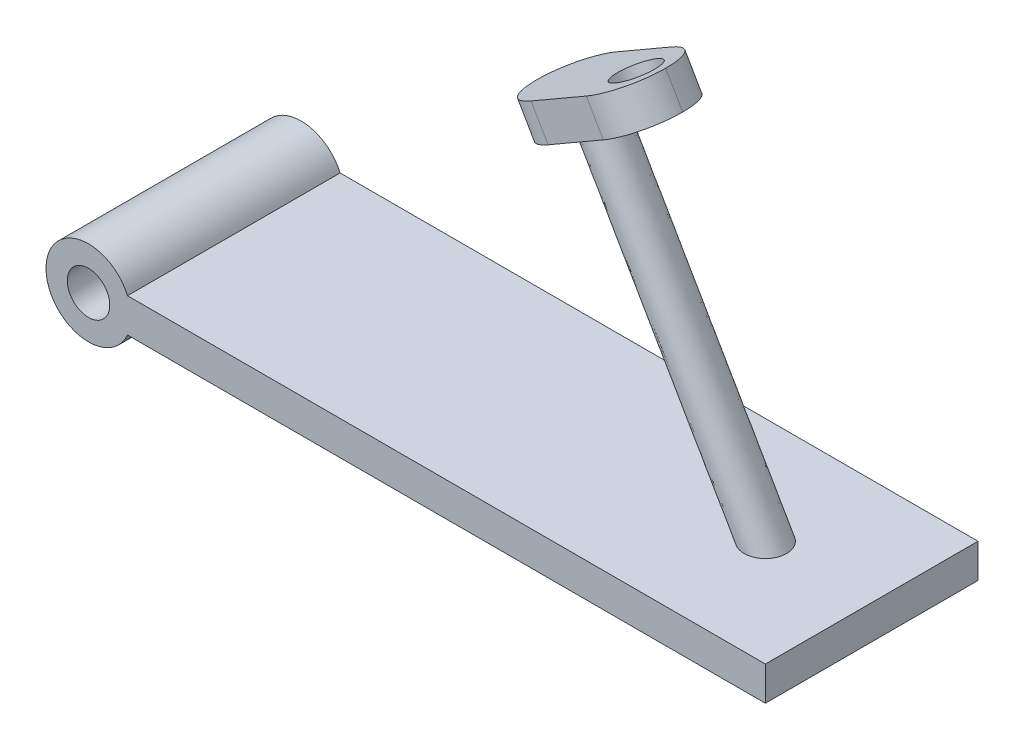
ISO-10303-21;
HEADER;
FILE_DESCRIPTION(('STEP AP214'),'2;1');
FILE_NAME('part.step','',(''),(''),'','','');
FILE_SCHEMA(('AUTOMOTIVE_DESIGN { 1 0 10303 214 1 1 1 1 }'));
ENDSEC;
DATA;
#1=APPLICATION_CONTEXT('core data for automotive mechanical design processes');
#2=APPLICATION_PROTOCOL_DEFINITION('international standard','automotive_design',2000,#1);
#3=PRODUCT_CONTEXT('',#1,'mechanical');
#4=PRODUCT('Part','Part','',(#3));
#5=PRODUCT_RELATED_PRODUCT_CATEGORY('part','',(#4));
#6=PRODUCT_DEFINITION_FORMATION('','',#4);
#7=PRODUCT_DEFINITION_CONTEXT('part definition',#1,'design');
#8=PRODUCT_DEFINITION('design','',#6,#7);
#9=PRODUCT_DEFINITION_SHAPE('','',#8);
#10=(LENGTH_UNIT() NAMED_UNIT(*) SI_UNIT(.MILLI.,.METRE.));
#11=(NAMED_UNIT(*) PLANE_ANGLE_UNIT() SI_UNIT($,.RADIAN.));
#12=(NAMED_UNIT(*) SI_UNIT($,.STERADIAN.) SOLID_ANGLE_UNIT());
#13=UNCERTAINTY_MEASURE_WITH_UNIT(LENGTH_MEASURE(1.E-05),#10,'distance_accuracy_value','');
#14=(GEOMETRIC_REPRESENTATION_CONTEXT(3) GLOBAL_UNCERTAINTY_ASSIGNED_CONTEXT((#13)) GLOBAL_UNIT_ASSIGNED_CONTEXT((#10,
#11,#12)) REPRESENTATION_CONTEXT('',''));
#15=CARTESIAN_POINT('',(0.,0.,0.));
#16=DIRECTION('',(0.,0.,1.));
#17=DIRECTION('',(1.,0.,0.));
#18=AXIS2_PLACEMENT_3D('',#15,#16,#17);
#19=CARTESIAN_POINT('',(64.1651513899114,73.2820323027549,0.));
#20=DIRECTION('',(0.,1.,0.));
#21=DIRECTION('',(0.,0.,0.999999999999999));
#22=AXIS2_PLACEMENT_3D('',#19,#20,#21);
#23=CIRCLE('',#22,5.);
#24=DIRECTION('',(0.500000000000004,-0.866025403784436,0.));
#25=VECTOR('',#24,1.);
#26=SURFACE_OF_LINEAR_EXTRUSION('',#23,#25);
#27=CARTESIAN_POINT('',(104.165151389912,3.99999999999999,0.));
#28=DIRECTION('',(0.,1.,0.));
#29=DIRECTION('',(0.,0.,0.999999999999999));
#30=AXIS2_PLACEMENT_3D('',#27,#28,#29);
#31=CIRCLE('',#30,5.);
#32=CARTESIAN_POINT('',(104.165151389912,3.99999999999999,5.));
#33=VERTEX_POINT('',#32);
#34=EDGE_CURVE('E165',#33,#33,#31,.T.);
#35=ORIENTED_EDGE('',*,*,#34,.T.);
#36=EDGE_LOOP('',(#35));
#37=FACE_BOUND('',#36,.T.);
#38=CARTESIAN_POINT('',(65.6651513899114,70.6839560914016,5.));
#39=CARTESIAN_POINT('',(65.7592594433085,70.7382894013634,5.00000064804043));
#40=CARTESIAN_POINT('',(65.8533609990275,70.7926189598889,4.99527194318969));
#41=CARTESIAN_POINT('',(66.0408883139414,70.9008879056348,4.97641814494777));
#42=CARTESIAN_POINT('',(66.1343138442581,70.9548271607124,4.96229000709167));
#43=CARTESIAN_POINT('',(66.3198834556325,71.0619658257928,4.92479347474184));
#44=CARTESIAN_POINT('',(66.4120257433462,71.115164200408,4.90141327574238));
#45=CARTESIAN_POINT('',(66.5942904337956,71.2203947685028,4.84569835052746));
#46=CARTESIAN_POINT('',(66.6844120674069,71.2724265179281,4.81336027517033));
#47=CARTESIAN_POINT('',(66.8617146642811,71.3747922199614,4.7402428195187));
#48=CARTESIAN_POINT('',(66.9489042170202,71.4251311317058,4.69949115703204));
#49=CARTESIAN_POINT('',(67.1201596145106,71.5240054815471,4.60992466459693));
#50=CARTESIAN_POINT('',(67.2042240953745,71.5725401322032,4.56110636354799));
#51=CARTESIAN_POINT('',(67.3686108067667,71.6674488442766,4.45601172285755));
#52=CARTESIAN_POINT('',(67.4489384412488,71.7138260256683,4.39974663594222));
#53=CARTESIAN_POINT('',(67.6056073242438,71.8042788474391,4.28024457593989));
#54=CARTESIAN_POINT('',(67.6819481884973,71.848354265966,4.21700693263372));
#55=CARTESIAN_POINT('',(67.8340036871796,71.936143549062,4.08082261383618));
#56=CARTESIAN_POINT('',(67.9094995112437,71.9797310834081,4.00754997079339));
#57=CARTESIAN_POINT('',(68.0554218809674,72.0639794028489,3.85463070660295));
#58=CARTESIAN_POINT('',(68.1258494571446,72.1046407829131,3.77498538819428));
#59=CARTESIAN_POINT('',(68.3304618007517,72.2227737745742,3.52587966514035));
#60=CARTESIAN_POINT('',(68.4566143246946,72.2956079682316,3.34748160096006));
#61=CARTESIAN_POINT('',(68.686214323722,72.428167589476,2.97208844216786));
#62=CARTESIAN_POINT('',(68.7896416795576,72.4878814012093,2.77507708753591));
#63=CARTESIAN_POINT('',(68.9357506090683,72.5722374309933,2.45017365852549));
#64=CARTESIAN_POINT('',(68.9860330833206,72.6012680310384,2.32674579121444));
#65=CARTESIAN_POINT('',(69.0782729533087,72.654522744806,2.0759200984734));
#66=CARTESIAN_POINT('',(69.1202374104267,72.6787509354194,1.94852574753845));
#67=CARTESIAN_POINT('',(69.1958453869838,72.7224032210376,1.69049183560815));
#68=CARTESIAN_POINT('',(69.2294889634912,72.7418273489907,1.55985229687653));
#69=CARTESIAN_POINT('',(69.2884436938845,72.7758648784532,1.29608942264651));
#70=CARTESIAN_POINT('',(69.3137530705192,72.7904772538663,1.16296556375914));
#71=CARTESIAN_POINT('',(69.3771315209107,72.8270688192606,0.761067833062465));
#72=CARTESIAN_POINT('',(69.4027206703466,72.8418427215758,0.489527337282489));
#73=CARTESIAN_POINT('',(69.4204941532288,72.8521042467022,-0.0548747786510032));
#74=CARTESIAN_POINT('',(69.4126799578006,72.8475927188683,-0.327736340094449));
#75=CARTESIAN_POINT('',(69.3636768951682,72.8193007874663,-0.869503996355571));
#76=CARTESIAN_POINT('',(69.3224860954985,72.7955192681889,-1.13840986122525));
#77=CARTESIAN_POINT('',(69.2067231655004,72.7286835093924,-1.66658424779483));
#78=CARTESIAN_POINT('',(69.132145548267,72.6856261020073,-1.92585117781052));
#79=CARTESIAN_POINT('',(68.949810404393,72.5803548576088,-2.42849366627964));
#80=CARTESIAN_POINT('',(68.8420435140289,72.5181356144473,-2.67186471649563));
#81=CARTESIAN_POINT('',(68.5946970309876,72.3753300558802,-3.13409717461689));
#82=CARTESIAN_POINT('',(68.4553408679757,72.2948727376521,-3.35311534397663));
#83=CARTESIAN_POINT('',(68.2291261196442,72.1642675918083,-3.65118074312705));
#84=CARTESIAN_POINT('',(68.1540721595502,72.1209351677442,-3.7424204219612));
#85=CARTESIAN_POINT('',(67.9976861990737,72.0306456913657,-3.91741028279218));
#86=CARTESIAN_POINT('',(67.9163566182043,71.9836900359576,-4.00116332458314));
#87=CARTESIAN_POINT('',(67.7532451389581,71.8895175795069,-4.15514613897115));
#88=CARTESIAN_POINT('',(67.6718342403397,71.8425149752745,-4.22590058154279));
#89=CARTESIAN_POINT('',(67.5041135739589,71.7456814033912,-4.35946311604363));
#90=CARTESIAN_POINT('',(67.41779842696,71.6958473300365,-4.42226222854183));
#91=CARTESIAN_POINT('',(67.2444133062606,71.5957433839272,-4.5367455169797));
#92=CARTESIAN_POINT('',(67.1575152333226,71.5455727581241,-4.58877664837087));
#93=CARTESIAN_POINT('',(66.9802321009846,71.4432182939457,-4.684195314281));
#94=CARTESIAN_POINT('',(66.8898473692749,71.3910346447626,-4.72758365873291));
#95=CARTESIAN_POINT('',(66.7062064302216,71.285009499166,-4.80517831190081));
#96=CARTESIAN_POINT('',(66.6129514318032,71.2311687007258,-4.83938842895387));
#97=CARTESIAN_POINT('',(66.4242382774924,71.1222151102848,-4.89819393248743));
#98=CARTESIAN_POINT('',(66.3287812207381,71.0671029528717,-4.92279401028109));
#99=CARTESIAN_POINT('',(66.1395467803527,70.9578483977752,-4.96141643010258));
#100=CARTESIAN_POINT('',(66.0458190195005,70.9037346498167,-4.97576316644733));
#101=CARTESIAN_POINT('',(65.8576565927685,70.7950990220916,-4.99499166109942));
#102=CARTESIAN_POINT('',(65.7632220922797,70.7405772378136,-4.99987556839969));
#103=CARTESIAN_POINT('',(65.5772542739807,70.6332086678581,-5.00011597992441));
#104=CARTESIAN_POINT('',(65.485721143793,70.5803619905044,-4.99576116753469));
#105=CARTESIAN_POINT('',(65.3032685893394,70.4750229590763,-4.9781586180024));
#106=CARTESIAN_POINT('',(65.2123493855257,70.4225307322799,-4.96490784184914));
#107=CARTESIAN_POINT('',(65.0316627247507,70.3182112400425,-4.92964487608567));
#108=CARTESIAN_POINT('',(64.9418970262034,70.2663849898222,-4.90762064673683));
#109=CARTESIAN_POINT('',(64.764237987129,70.1638134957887,-4.8550819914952));
#110=CARTESIAN_POINT('',(64.676345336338,70.1130686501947,-4.8245644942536));
#111=CARTESIAN_POINT('',(64.4151082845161,69.962243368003,-4.72026700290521));
#112=CARTESIAN_POINT('',(64.2453946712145,69.8642591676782,-4.63397834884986));
#113=CARTESIAN_POINT('',(63.9200008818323,69.6763929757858,-4.43203752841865));
#114=CARTESIAN_POINT('',(63.7643051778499,69.5865020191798,-4.31641840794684));
#115=CARTESIAN_POINT('',(63.5385113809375,69.4561399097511,-4.12012620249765));
#116=CARTESIAN_POINT('',(63.4624440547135,69.4122224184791,-4.04840875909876));
#117=CARTESIAN_POINT('',(63.3152674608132,69.3272499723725,-3.89851660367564));
#118=CARTESIAN_POINT('',(63.2441573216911,69.2861945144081,-3.82034303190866));
#119=CARTESIAN_POINT('',(63.0373641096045,69.1668023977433,-3.57556857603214));
#120=CARTESIAN_POINT('',(62.9095935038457,69.093034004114,-3.39992177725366));
#121=CARTESIAN_POINT('',(62.6764822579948,68.9584471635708,-3.02971184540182));
#122=CARTESIAN_POINT('',(62.5711614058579,68.8976401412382,-2.83513224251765));
#123=CARTESIAN_POINT('',(62.4219517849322,68.8114939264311,-2.5140567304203));
#124=CARTESIAN_POINT('',(62.3705215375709,68.7818006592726,-2.39213866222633));
#125=CARTESIAN_POINT('',(62.2758817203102,68.7271603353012,-2.14423035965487));
#126=CARTESIAN_POINT('',(62.2326651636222,68.7022092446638,-2.01824369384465));
#127=CARTESIAN_POINT('',(62.1544520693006,68.6570528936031,-1.7629200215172));
#128=CARTESIAN_POINT('',(62.1194554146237,68.6368475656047,-1.63358306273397));
#129=CARTESIAN_POINT('',(62.0576956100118,68.6011905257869,-1.37231335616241));
#130=CARTESIAN_POINT('',(62.0309342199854,68.5857398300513,-1.24038005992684));
#131=CARTESIAN_POINT('',(61.9630551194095,68.5465498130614,-0.841878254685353));
#132=CARTESIAN_POINT('',(61.9342699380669,68.5299306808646,-0.572368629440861));
#133=CARTESIAN_POINT('',(61.9097194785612,68.5157564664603,-0.0314889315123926));
#134=CARTESIAN_POINT('',(61.9139524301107,68.5182003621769,0.23988104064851));
#135=CARTESIAN_POINT('',(61.9554045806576,68.5421327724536,0.779302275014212));
#136=CARTESIAN_POINT('',(61.9926252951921,68.5636221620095,1.04735338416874));
#137=CARTESIAN_POINT('',(62.1000656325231,68.6256528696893,1.57459658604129));
#138=CARTESIAN_POINT('',(62.1702901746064,68.6661970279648,1.83378735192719));
#139=CARTESIAN_POINT('',(62.3435685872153,68.7662393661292,2.33724310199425));
#140=CARTESIAN_POINT('',(62.4466310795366,68.8257425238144,2.58150414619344));
#141=CARTESIAN_POINT('',(62.6852049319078,68.9634832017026,3.04841744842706));
#142=CARTESIAN_POINT('',(62.8207289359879,69.0417280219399,3.27106123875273));
#143=CARTESIAN_POINT('',(63.04217490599,69.1695799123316,3.57593094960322));
#144=CARTESIAN_POINT('',(63.11619911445,69.2123178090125,3.66991749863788));
#145=CARTESIAN_POINT('',(63.2707280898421,69.3015351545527,3.85048886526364));
#146=CARTESIAN_POINT('',(63.3512304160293,69.3480131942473,3.93707644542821));
#147=CARTESIAN_POINT('',(63.5128494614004,69.4413239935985,4.09650855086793));
#148=CARTESIAN_POINT('',(63.5935746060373,69.487930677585,4.16988301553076));
#149=CARTESIAN_POINT('',(63.7601105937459,69.5840802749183,4.30874503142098));
#150=CARTESIAN_POINT('',(63.8459268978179,69.6336263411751,4.37422387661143));
#151=CARTESIAN_POINT('',(64.0183875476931,69.7331965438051,4.49389052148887));
#152=CARTESIAN_POINT('',(64.1048447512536,69.7831126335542,4.54843774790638));
#153=CARTESIAN_POINT('',(64.2814305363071,69.8850644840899,4.64892439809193));
#154=CARTESIAN_POINT('',(64.3715587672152,69.9371000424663,4.69486464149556));
#155=CARTESIAN_POINT('',(64.5548950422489,70.0429492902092,4.77757586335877));
#156=CARTESIAN_POINT('',(64.6481022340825,70.0967624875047,4.81434935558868));
#157=CARTESIAN_POINT('',(64.8369208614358,70.2057769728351,4.87825427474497));
#158=CARTESIAN_POINT('',(64.9325312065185,70.2609776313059,4.90538999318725));
#159=CARTESIAN_POINT('',(65.1336765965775,70.3771089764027,4.9515540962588));
#160=CARTESIAN_POINT('',(65.2393649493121,70.4381281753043,4.96969829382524));
#161=CARTESIAN_POINT('',(65.4517555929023,70.5607519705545,4.99391961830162));
#162=CARTESIAN_POINT('',(65.5584576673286,70.6223564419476,4.99999926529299));
#163=CARTESIAN_POINT('',(65.6651513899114,70.6839560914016,5.));
#164=B_SPLINE_CURVE_WITH_KNOTS('',3,(#38,#39,#40,#41,#42,#43,#44,#45,#46,#47,#48,#49,#50,#51,
#52,#53,#54,#55,#56,#57,#58,#59,#60,#61,#62,#63,#64,#65,#66,#67,#68,#69,#70,#71,#72,#73,#74,#75,
#76,#77,#78,#79,#80,#81,#82,#83,#84,#85,#86,#87,#88,#89,#90,#91,#92,#93,#94,#95,#96,#97,#98,#99,
#100,#101,#102,#103,#104,#105,#106,#107,#108,#109,#110,#111,#112,#113,#114,#115,#116,#117,#118,
#119,#120,#121,#122,#123,#124,#125,#126,#127,#128,#129,#130,#131,#132,#133,#134,#135,#136,#137,
#138,#139,#140,#141,#142,#143,#144,#145,#146,#147,#148,#149,#150,#151,#152,#153,#154,#155,#156,
#157,#158,#159,#160,#161,#162,#163),.UNSPECIFIED.,.T.,.F.,(4,2,2,2,2,2,2,2,2,2,2,2,2,2,2,2,2,2,
2,2,2,2,2,2,2,2,2,2,2,2,2,2,2,2,2,2,2,2,2,2,2,2,2,2,2,2,2,2,2,2,2,2,2,2,2,2,2,2,2,2,2,2,4),(0.,
0.325884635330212,0.651874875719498,0.978282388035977,1.30481210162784,1.63028278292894,
1.9558938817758,2.28101845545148,2.60617430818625,2.94745545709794,3.28866701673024,
3.9770230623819,4.66598609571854,5.07483576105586,5.48333684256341,5.89183512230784,
6.30042045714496,7.11683738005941,7.93321834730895,8.74964658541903,9.56620904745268,
10.3830020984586,11.1941889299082,11.5713604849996,11.9483873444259,12.3009765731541,
12.6539603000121,12.9926594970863,13.3313269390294,13.6698536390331,14.008214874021,
14.3353300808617,14.6623709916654,14.9793435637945,15.2964244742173,15.6139420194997,
15.9315745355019,16.5709711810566,17.2096506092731,17.5495412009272,17.8893718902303,
18.5749576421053,19.2611452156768,19.6676295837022,20.0737666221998,20.4798978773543,
20.8861158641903,21.697798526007,22.5094376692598,23.3211141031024,24.1329115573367,
24.9449223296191,25.7572499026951,26.1380252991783,26.5186578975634,26.8741566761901,
27.230043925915,27.5709403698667,27.911804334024,28.2525747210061,28.5931931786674,
28.962737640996,29.3322049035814),.UNSPECIFIED.);
#165=CARTESIAN_POINT('',(65.6651513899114,70.6839560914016,5.));
#166=VERTEX_POINT('',#165);
#167=EDGE_CURVE('E138',#166,#166,#164,.T.);
#168=ORIENTED_EDGE('',*,*,#167,.F.);
#169=EDGE_LOOP('',(#168));
#170=FACE_BOUND('',#169,.T.);
#171=ADVANCED_FACE('F48',(#37,#170),#26,.F.);
#172=CARTESIAN_POINT('',(0.,4.,25.));
#173=DIRECTION('',(0.,1.,0.));
#174=DIRECTION('',(0.,0.,0.999999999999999));
#175=AXIS2_PLACEMENT_3D('',#172,#173,#174);
#176=PLANE('',#175);
#177=ORIENTED_EDGE('',*,*,#34,.F.);
#178=EDGE_LOOP('',(#177));
#179=FACE_BOUND('',#178,.T.);
#180=DIRECTION('',(1.,0.,0.));
#181=VECTOR('',#180,1.);
#182=CARTESIAN_POINT('',(0.,4.,-25.));
#183=LINE('',#182,#181);
#184=CARTESIAN_POINT('',(-20.8348486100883,4.,-25.));
#185=VERTEX_POINT('',#184);
#186=CARTESIAN_POINT('',(129.165151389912,4.,-25.));
#187=VERTEX_POINT('',#186);
#188=EDGE_CURVE('E134',#185,#187,#183,.T.);
#189=ORIENTED_EDGE('',*,*,#188,.F.);
#190=DIRECTION('',(0.,0.,-0.999999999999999));
#191=VECTOR('',#190,1.);
#192=CARTESIAN_POINT('',(-20.8348486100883,4.,25.));
#193=LINE('',#192,#191);
#194=CARTESIAN_POINT('',(-20.8348486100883,4.,25.));
#195=VERTEX_POINT('',#194);
#196=EDGE_CURVE('E127',#195,#185,#193,.T.);
#197=ORIENTED_EDGE('',*,*,#196,.F.);
#198=DIRECTION('',(1.,0.,0.));
#199=VECTOR('',#198,1.);
#200=CARTESIAN_POINT('',(0.,4.,25.));
#201=LINE('',#200,#199);
#202=CARTESIAN_POINT('',(129.165151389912,4.,25.));
#203=VERTEX_POINT('',#202);
#204=EDGE_CURVE('E131',#195,#203,#201,.T.);
#205=ORIENTED_EDGE('',*,*,#204,.T.);
#206=DIRECTION('',(0.,0.,-0.999999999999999));
#207=VECTOR('',#206,1.);
#208=CARTESIAN_POINT('',(129.165151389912,4.,25.));
#209=LINE('',#208,#207);
#210=EDGE_CURVE('E161',#203,#187,#209,.T.);
#211=ORIENTED_EDGE('',*,*,#210,.T.);
#212=EDGE_LOOP('',(#189,#197,#205,#211));
#213=FACE_BOUND('',#212,.T.);
#214=ADVANCED_FACE('F129',(#179,#213),#176,.T.);
#215=CARTESIAN_POINT('',(-30.,0.,25.));
#216=DIRECTION('',(0.,0.,-0.999999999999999));
#217=DIRECTION('',(-1.,0.,0.));
#218=AXIS2_PLACEMENT_3D('',#215,#216,#217);
#219=CYLINDRICAL_SURFACE('',#218,10.);
#220=CARTESIAN_POINT('',(-30.,0.,-25.));
#221=DIRECTION('',(0.,0.,0.999999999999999));
#222=DIRECTION('',(1.,0.,0.));
#223=AXIS2_PLACEMENT_3D('',#220,#221,#222);
#224=CIRCLE('',#223,10.);
#225=CARTESIAN_POINT('',(-20.8348486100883,-4.,-25.));
#226=VERTEX_POINT('',#225);
#227=EDGE_CURVE('E167',#185,#226,#224,.T.);
#228=ORIENTED_EDGE('',*,*,#227,.T.);
#229=DIRECTION('',(0.,0.,-0.999999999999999));
#230=VECTOR('',#229,1.);
#231=CARTESIAN_POINT('',(-20.8348486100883,-4.,25.));
#232=LINE('',#231,#230);
#233=CARTESIAN_POINT('',(-20.8348486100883,-4.,25.));
#234=VERTEX_POINT('',#233);
#235=EDGE_CURVE('E139',#234,#226,#232,.T.);
#236=ORIENTED_EDGE('',*,*,#235,.F.);
#237=CARTESIAN_POINT('',(-30.,0.,25.));
#238=DIRECTION('',(0.,0.,0.999999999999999));
#239=DIRECTION('',(1.,0.,0.));
#240=AXIS2_PLACEMENT_3D('',#237,#238,#239);
#241=CIRCLE('',#240,10.);
#242=EDGE_CURVE('E143',#195,#234,#241,.T.);
#243=ORIENTED_EDGE('',*,*,#242,.F.);
#244=ORIENTED_EDGE('',*,*,#196,.T.);
#245=EDGE_LOOP('',(#228,#236,#243,#244));
#246=FACE_BOUND('',#245,.T.);
#247=ADVANCED_FACE('F144',(#246),#219,.T.);
#248=CARTESIAN_POINT('',(0.,-4.,25.));
#249=DIRECTION('',(0.,1.,0.));
#250=DIRECTION('',(-1.,0.,0.));
#251=AXIS2_PLACEMENT_3D('',#248,#249,#250);
#252=PLANE('',#251);
#253=DIRECTION('',(1.,0.,0.));
#254=VECTOR('',#253,1.);
#255=CARTESIAN_POINT('',(0.,-4.,-25.));
#256=LINE('',#255,#254);
#257=CARTESIAN_POINT('',(129.165151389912,-3.99999999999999,-25.));
#258=VERTEX_POINT('',#257);
#259=EDGE_CURVE('E169',#226,#258,#256,.T.);
#260=ORIENTED_EDGE('',*,*,#259,.T.);
#261=DIRECTION('',(0.,0.,-0.999999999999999));
#262=VECTOR('',#261,1.);
#263=CARTESIAN_POINT('',(129.165151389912,-3.99999999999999,25.));
#264=LINE('',#263,#262);
#265=CARTESIAN_POINT('',(129.165151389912,-3.99999999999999,25.));
#266=VERTEX_POINT('',#265);
#267=EDGE_CURVE('E175',#266,#258,#264,.T.);
#268=ORIENTED_EDGE('',*,*,#267,.F.);
#269=DIRECTION('',(1.,0.,0.));
#270=VECTOR('',#269,1.);
#271=CARTESIAN_POINT('',(0.,-4.,25.));
#272=LINE('',#271,#270);
#273=EDGE_CURVE('E147',#234,#266,#272,.T.);
#274=ORIENTED_EDGE('',*,*,#273,.F.);
#275=ORIENTED_EDGE('',*,*,#235,.T.);
#276=EDGE_LOOP('',(#260,#268,#274,#275));
#277=FACE_BOUND('',#276,.T.);
#278=ADVANCED_FACE('F353',(#277),#252,.F.);
#279=CARTESIAN_POINT('',(-30.,0.,25.));
#280=DIRECTION('',(0.,0.,-0.999999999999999));
#281=DIRECTION('',(-1.,0.,0.));
#282=AXIS2_PLACEMENT_3D('',#279,#280,#281);
#283=CYLINDRICAL_SURFACE('',#282,5.);
#284=CARTESIAN_POINT('',(-30.,0.,25.));
#285=DIRECTION('',(0.,0.,0.999999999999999));
#286=DIRECTION('',(1.,0.,0.));
#287=AXIS2_PLACEMENT_3D('',#284,#285,#286);
#288=CIRCLE('',#287,5.);
#289=CARTESIAN_POINT('',(-35.,0.,25.));
#290=VERTEX_POINT('',#289);
#291=EDGE_CURVE('E152',#290,#290,#288,.T.);
#292=CARTESIAN_POINT('',(-30.,0.,-25.));
#293=DIRECTION('',(0.,0.,0.999999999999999));
#294=DIRECTION('',(1.,0.,0.));
#295=AXIS2_PLACEMENT_3D('',#292,#293,#294);
#296=CIRCLE('',#295,5.);
#297=CARTESIAN_POINT('',(-35.,0.,-25.));
#298=VERTEX_POINT('',#297);
#299=EDGE_CURVE('E162',#298,#298,#296,.T.);
#300=CARTESIAN_POINT('',(-35.,0.,25.));
#301=CARTESIAN_POINT('',(-35.,0.,24.4791666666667));
#302=CARTESIAN_POINT('',(-35.,0.,23.9583333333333));
#303=CARTESIAN_POINT('',(-35.,0.,22.9166666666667));
#304=CARTESIAN_POINT('',(-35.,0.,22.3958333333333));
#305=CARTESIAN_POINT('',(-35.,0.,21.3541666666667));
#306=CARTESIAN_POINT('',(-35.,0.,20.8333333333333));
#307=CARTESIAN_POINT('',(-35.,0.,19.7916666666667));
#308=CARTESIAN_POINT('',(-35.,0.,19.2708333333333));
#309=CARTESIAN_POINT('',(-35.,0.,18.2291666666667));
#310=CARTESIAN_POINT('',(-35.,0.,17.7083333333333));
#311=CARTESIAN_POINT('',(-35.,0.,16.6666666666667));
#312=CARTESIAN_POINT('',(-35.,0.,16.1458333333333));
#313=CARTESIAN_POINT('',(-35.,0.,15.1041666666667));
#314=CARTESIAN_POINT('',(-35.,0.,14.5833333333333));
#315=CARTESIAN_POINT('',(-35.,0.,13.5416666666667));
#316=CARTESIAN_POINT('',(-35.,0.,13.0208333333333));
#317=CARTESIAN_POINT('',(-35.,0.,11.9791666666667));
#318=CARTESIAN_POINT('',(-35.,0.,11.4583333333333));
#319=CARTESIAN_POINT('',(-35.,0.,10.4166666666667));
#320=CARTESIAN_POINT('',(-35.,0.,9.89583333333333));
#321=CARTESIAN_POINT('',(-35.,0.,8.85416666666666));
#322=CARTESIAN_POINT('',(-35.,0.,8.33333333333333));
#323=CARTESIAN_POINT('',(-35.,0.,7.29166666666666));
#324=CARTESIAN_POINT('',(-35.,0.,6.77083333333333));
#325=CARTESIAN_POINT('',(-35.,0.,5.72916666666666));
#326=CARTESIAN_POINT('',(-35.,0.,5.20833333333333));
#327=CARTESIAN_POINT('',(-35.,0.,4.16666666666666));
#328=CARTESIAN_POINT('',(-35.,0.,3.64583333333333));
#329=CARTESIAN_POINT('',(-35.,0.,2.60416666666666));
#330=CARTESIAN_POINT('',(-35.,0.,2.08333333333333));
#331=CARTESIAN_POINT('',(-35.,0.,1.04166666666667));
#332=CARTESIAN_POINT('',(-35.,0.,0.520833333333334));
#333=CARTESIAN_POINT('',(-35.,0.,-0.520833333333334));
#334=CARTESIAN_POINT('',(-35.,0.,-1.04166666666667));
#335=CARTESIAN_POINT('',(-35.,0.,-2.08333333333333));
#336=CARTESIAN_POINT('',(-35.,0.,-2.60416666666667));
#337=CARTESIAN_POINT('',(-35.,0.,-3.64583333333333));
#338=CARTESIAN_POINT('',(-35.,0.,-4.16666666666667));
#339=CARTESIAN_POINT('',(-35.,0.,-5.20833333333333));
#340=CARTESIAN_POINT('',(-35.,0.,-5.72916666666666));
#341=CARTESIAN_POINT('',(-35.,0.,-6.77083333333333));
#342=CARTESIAN_POINT('',(-35.,0.,-7.29166666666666));
#343=CARTESIAN_POINT('',(-35.,0.,-8.33333333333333));
#344=CARTESIAN_POINT('',(-35.,0.,-8.85416666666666));
#345=CARTESIAN_POINT('',(-35.,0.,-9.89583333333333));
#346=CARTESIAN_POINT('',(-35.,0.,-10.4166666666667));
#347=CARTESIAN_POINT('',(-35.,0.,-11.4583333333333));
#348=CARTESIAN_POINT('',(-35.,0.,-11.9791666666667));
#349=CARTESIAN_POINT('',(-35.,0.,-13.0208333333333));
#350=CARTESIAN_POINT('',(-35.,0.,-13.5416666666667));
#351=CARTESIAN_POINT('',(-35.,0.,-14.5833333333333));
#352=CARTESIAN_POINT('',(-35.,0.,-15.1041666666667));
#353=CARTESIAN_POINT('',(-35.,0.,-16.1458333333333));
#354=CARTESIAN_POINT('',(-35.,0.,-16.6666666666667));
#355=CARTESIAN_POINT('',(-35.,0.,-17.7083333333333));
#356=CARTESIAN_POINT('',(-35.,0.,-18.2291666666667));
#357=CARTESIAN_POINT('',(-35.,0.,-19.2708333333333));
#358=CARTESIAN_POINT('',(-35.,0.,-19.7916666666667));
#359=CARTESIAN_POINT('',(-35.,0.,-20.8333333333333));
#360=CARTESIAN_POINT('',(-35.,0.,-21.3541666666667));
#361=CARTESIAN_POINT('',(-35.,0.,-22.3958333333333));
#362=CARTESIAN_POINT('',(-35.,0.,-22.9166666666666));
#363=CARTESIAN_POINT('',(-35.,0.,-23.9583333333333));
#364=CARTESIAN_POINT('',(-35.,0.,-24.4791666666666));
#365=CARTESIAN_POINT('',(-35.,0.,-25.));
#366=B_SPLINE_CURVE_WITH_KNOTS('',3,(#300,#301,#302,#303,#304,#305,#306,#307,#308,#309,#310,
#311,#312,#313,#314,#315,#316,#317,#318,#319,#320,#321,#322,#323,#324,#325,#326,#327,#328,#329,
#330,#331,#332,#333,#334,#335,#336,#337,#338,#339,#340,#341,#342,#343,#344,#345,#346,#347,#348,
#349,#350,#351,#352,#353,#354,#355,#356,#357,#358,#359,#360,#361,#362,#363,#364,#365),
.UNSPECIFIED.,.F.,.F.,(4,2,2,2,2,2,2,2,2,2,2,2,2,2,2,2,2,2,2,2,2,2,2,2,2,2,2,2,2,2,2,2,4),(0.,
1.5625,3.125,4.68749999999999,6.25,7.81249999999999,9.37499999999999,10.9375,12.5,14.0625,
15.625,17.1875,18.75,20.3125,21.875,23.4375,25.,26.5625,28.125,29.6875,31.25,32.8125,34.375,
35.9375,37.5,39.0625,40.625,42.1875,43.75,45.3125,46.875,48.4375,50.),.UNSPECIFIED.);
#367=EDGE_CURVE('BSEAM288',#290,#298,#366,.T.);
#368=ORIENTED_EDGE('',*,*,#291,.T.);
#369=ORIENTED_EDGE('',*,*,#299,.F.);
#370=ORIENTED_EDGE('',*,*,#367,.T.);
#371=ORIENTED_EDGE('',*,*,#367,.F.);
#372=EDGE_LOOP('',(#368,#370,#369,#371));
#373=FACE_BOUND('',#372,.T.);
#374=ADVANCED_FACE('F288',(#373),#283,.F.);
#375=CARTESIAN_POINT('',(129.165151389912,0.,25.));
#376=DIRECTION('',(1.,0.,0.));
#377=DIRECTION('',(0.,0.,-0.999999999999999));
#378=AXIS2_PLACEMENT_3D('',#375,#376,#377);
#379=PLANE('',#378);
#380=DIRECTION('',(0.,-1.,0.));
#381=VECTOR('',#380,1.);
#382=CARTESIAN_POINT('',(129.165151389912,0.,-25.));
#383=LINE('',#382,#381);
#384=EDGE_CURVE('E155',#187,#258,#383,.T.);
#385=ORIENTED_EDGE('',*,*,#384,.F.);
#386=ORIENTED_EDGE('',*,*,#210,.F.);
#387=DIRECTION('',(0.,-1.,0.));
#388=VECTOR('',#387,1.);
#389=CARTESIAN_POINT('',(129.165151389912,0.,25.));
#390=LINE('',#389,#388);
#391=EDGE_CURVE('E151',#203,#266,#390,.T.);
#392=ORIENTED_EDGE('',*,*,#391,.T.);
#393=ORIENTED_EDGE('',*,*,#267,.T.);
#394=EDGE_LOOP('',(#385,#386,#392,#393));
#395=FACE_BOUND('',#394,.T.);
#396=ADVANCED_FACE('F339',(#395),#379,.T.);
#397=CARTESIAN_POINT('',(0.,0.,25.));
#398=DIRECTION('',(0.,0.,0.999999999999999));
#399=DIRECTION('',(1.,0.,0.));
#400=AXIS2_PLACEMENT_3D('',#397,#398,#399);
#401=PLANE('',#400);
#402=ORIENTED_EDGE('',*,*,#291,.F.);
#403=EDGE_LOOP('',(#402));
#404=FACE_BOUND('',#403,.T.);
#405=ORIENTED_EDGE('',*,*,#204,.F.);
#406=ORIENTED_EDGE('',*,*,#242,.T.);
#407=ORIENTED_EDGE('',*,*,#273,.T.);
#408=ORIENTED_EDGE('',*,*,#391,.F.);
#409=EDGE_LOOP('',(#405,#406,#407,#408));
#410=FACE_BOUND('',#409,.T.);
#411=ADVANCED_FACE('F149',(#404,#410),#401,.T.);
#412=CARTESIAN_POINT('',(0.,0.,-25.));
#413=DIRECTION('',(0.,0.,0.999999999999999));
#414=DIRECTION('',(1.,0.,0.));
#415=AXIS2_PLACEMENT_3D('',#412,#413,#414);
#416=PLANE('',#415);
#417=ORIENTED_EDGE('',*,*,#299,.T.);
#418=EDGE_LOOP('',(#417));
#419=FACE_BOUND('',#418,.T.);
#420=ORIENTED_EDGE('',*,*,#188,.T.);
#421=ORIENTED_EDGE('',*,*,#384,.T.);
#422=ORIENTED_EDGE('',*,*,#259,.F.);
#423=ORIENTED_EDGE('',*,*,#227,.F.);
#424=EDGE_LOOP('',(#420,#421,#422,#423));
#425=FACE_BOUND('',#424,.T.);
#426=ADVANCED_FACE('F195',(#419,#425),#416,.F.);
#427=CARTESIAN_POINT('',(65.6651513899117,70.6839560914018,9.99999999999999));
#428=DIRECTION('',(-0.5,0.866025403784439,0.));
#429=DIRECTION('',(-0.866025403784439,-0.5,0.));
#430=AXIS2_PLACEMENT_3D('',#427,#428,#429);
#431=PLANE('',#430);
#432=CARTESIAN_POINT('',(77.7895070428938,77.6839560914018,0.));
#433=DIRECTION('',(-0.5,0.866025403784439,0.));
#434=DIRECTION('',(-0.866025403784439,-0.5,0.));
#435=AXIS2_PLACEMENT_3D('',#432,#433,#434);
#436=CIRCLE('',#435,5.00000000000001);
#437=CARTESIAN_POINT('',(73.4593800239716,75.1839560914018,0.));
#438=VERTEX_POINT('',#437);
#439=EDGE_CURVE('E229',#438,#438,#436,.F.);
#440=ORIENTED_EDGE('',*,*,#439,.F.);
#441=EDGE_LOOP('',(#440));
#442=FACE_BOUND('',#441,.T.);
#443=DIRECTION('',(0.86602540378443,0.500000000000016,0.));
#444=VECTOR('',#443,1.);
#445=CARTESIAN_POINT('',(84.7177102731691,81.6839560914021,9.99999999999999));
#446=LINE('',#445,#444);
#447=CARTESIAN_POINT('',(63.0670751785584,69.1839560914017,9.99999999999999));
#448=VERTEX_POINT('',#447);
#449=CARTESIAN_POINT('',(76.0574562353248,76.6839560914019,9.99999999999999));
#450=VERTEX_POINT('',#449);
#451=EDGE_CURVE('E221',#448,#450,#446,.T.);
#452=ORIENTED_EDGE('',*,*,#451,.F.);
#453=CARTESIAN_POINT('',(63.0670751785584,69.1839560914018,0.));
#454=DIRECTION('',(-0.5,0.866025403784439,0.));
#455=DIRECTION('',(-0.866025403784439,-0.5,0.));
#456=AXIS2_PLACEMENT_3D('',#453,#454,#455);
#457=CIRCLE('',#456,10.);
#458=CARTESIAN_POINT('',(54.406821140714,64.1839560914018,0.));
#459=VERTEX_POINT('',#458);
#460=EDGE_CURVE('E252',#448,#459,#457,.F.);
#461=ORIENTED_EDGE('',*,*,#460,.T.);
#462=CARTESIAN_POINT('',(63.0670751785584,69.1839560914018,0.));
#463=DIRECTION('',(-0.5,0.866025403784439,0.));
#464=DIRECTION('',(-0.866025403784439,-0.5,0.));
#465=AXIS2_PLACEMENT_3D('',#462,#463,#464);
#466=CIRCLE('',#465,10.);
#467=CARTESIAN_POINT('',(63.0670751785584,69.1839560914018,-9.99999999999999));
#468=VERTEX_POINT('',#467);
#469=EDGE_CURVE('E254',#459,#468,#466,.F.);
#470=ORIENTED_EDGE('',*,*,#469,.T.);
#471=DIRECTION('',(0.866025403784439,0.5,0.));
#472=VECTOR('',#471,1.);
#473=CARTESIAN_POINT('',(65.6651513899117,70.6839560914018,-9.99999999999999));
#474=LINE('',#473,#472);
#475=CARTESIAN_POINT('',(76.0574562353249,76.6839560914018,-9.99999999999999));
#476=VERTEX_POINT('',#475);
#477=EDGE_CURVE('E225',#468,#476,#474,.T.);
#478=ORIENTED_EDGE('',*,*,#477,.T.);
#479=CARTESIAN_POINT('',(76.0574562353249,76.6839560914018,0.));
#480=DIRECTION('',(-0.5,0.866025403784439,0.));
#481=DIRECTION('',(-0.866025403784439,-0.5,0.));
#482=AXIS2_PLACEMENT_3D('',#479,#480,#481);
#483=CIRCLE('',#482,10.);
#484=CARTESIAN_POINT('',(84.7177102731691,81.6839560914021,0.));
#485=VERTEX_POINT('',#484);
#486=EDGE_CURVE('E256',#476,#485,#483,.F.);
#487=ORIENTED_EDGE('',*,*,#486,.T.);
#488=CARTESIAN_POINT('',(76.0574562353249,76.6839560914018,0.));
#489=DIRECTION('',(-0.5,0.866025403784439,0.));
#490=DIRECTION('',(-0.866025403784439,-0.5,0.));
#491=AXIS2_PLACEMENT_3D('',#488,#489,#490);
#492=CIRCLE('',#491,10.);
#493=EDGE_CURVE('E258',#485,#450,#492,.F.);
#494=ORIENTED_EDGE('',*,*,#493,.T.);
#495=EDGE_LOOP('',(#452,#461,#470,#478,#487,#494));
#496=FACE_BOUND('',#495,.T.);
#497=ORIENTED_EDGE('',*,*,#167,.T.);
#498=EDGE_LOOP('',(#497));
#499=FACE_BOUND('',#498,.T.);
#500=ADVANCED_FACE('F190',(#442,#496,#499),#431,.F.);
#501=CARTESIAN_POINT('',(50.4068211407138,71.1121593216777,9.99999999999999));
#502=DIRECTION('',(0.5,-0.866025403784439,0.));
#503=DIRECTION('',(0.866025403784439,0.5,0.));
#504=AXIS2_PLACEMENT_3D('',#501,#502,#503);
#505=PLANE('',#504);
#506=CARTESIAN_POINT('',(73.7895070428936,84.6121593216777,0.));
#507=DIRECTION('',(-0.5,0.866025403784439,0.));
#508=DIRECTION('',(-0.866025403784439,-0.5,0.));
#509=AXIS2_PLACEMENT_3D('',#506,#507,#508);
#510=CIRCLE('',#509,5.00000000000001);
#511=CARTESIAN_POINT('',(69.4593800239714,82.1121593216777,0.));
#512=VERTEX_POINT('',#511);
#513=EDGE_CURVE('E235',#512,#512,#510,.T.);
#514=ORIENTED_EDGE('',*,*,#513,.F.);
#515=EDGE_LOOP('',(#514));
#516=FACE_BOUND('',#515,.T.);
#517=CARTESIAN_POINT('',(59.0670751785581,76.1121593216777,0.));
#518=DIRECTION('',(0.5,-0.866025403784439,0.));
#519=DIRECTION('',(0.866025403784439,0.5,0.));
#520=AXIS2_PLACEMENT_3D('',#517,#518,#519);
#521=CIRCLE('',#520,10.);
#522=CARTESIAN_POINT('',(59.0670751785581,76.1121593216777,-9.99999999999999));
#523=VERTEX_POINT('',#522);
#524=CARTESIAN_POINT('',(50.4068211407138,71.1121593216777,0.));
#525=VERTEX_POINT('',#524);
#526=EDGE_CURVE('E72',#523,#525,#521,.F.);
#527=ORIENTED_EDGE('',*,*,#526,.T.);
#528=CARTESIAN_POINT('',(59.0670751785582,76.1121593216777,0.));
#529=DIRECTION('',(0.5,-0.866025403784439,0.));
#530=DIRECTION('',(0.866025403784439,0.5,0.));
#531=AXIS2_PLACEMENT_3D('',#528,#529,#530);
#532=CIRCLE('',#531,10.);
#533=CARTESIAN_POINT('',(59.0670751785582,76.1121593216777,9.99999999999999));
#534=VERTEX_POINT('',#533);
#535=EDGE_CURVE('E246',#525,#534,#532,.F.);
#536=ORIENTED_EDGE('',*,*,#535,.T.);
#537=DIRECTION('',(-0.866025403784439,-0.5,0.));
#538=VECTOR('',#537,1.);
#539=CARTESIAN_POINT('',(50.4068211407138,71.1121593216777,9.99999999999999));
#540=LINE('',#539,#538);
#541=CARTESIAN_POINT('',(72.0574562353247,83.6121593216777,9.99999999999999));
#542=VERTEX_POINT('',#541);
#543=EDGE_CURVE('E219',#542,#534,#540,.T.);
#544=ORIENTED_EDGE('',*,*,#543,.F.);
#545=CARTESIAN_POINT('',(72.0574562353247,83.6121593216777,0.));
#546=DIRECTION('',(0.5,-0.866025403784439,0.));
#547=DIRECTION('',(0.866025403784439,0.5,0.));
#548=AXIS2_PLACEMENT_3D('',#545,#546,#547);
#549=CIRCLE('',#548,10.);
#550=CARTESIAN_POINT('',(80.7177102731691,88.6121593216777,0.));
#551=VERTEX_POINT('',#550);
#552=EDGE_CURVE('E65',#542,#551,#549,.F.);
#553=ORIENTED_EDGE('',*,*,#552,.T.);
#554=CARTESIAN_POINT('',(72.0574562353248,83.6121593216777,0.));
#555=DIRECTION('',(0.5,-0.866025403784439,0.));
#556=DIRECTION('',(0.866025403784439,0.5,0.));
#557=AXIS2_PLACEMENT_3D('',#554,#555,#556);
#558=CIRCLE('',#557,10.);
#559=CARTESIAN_POINT('',(72.0574562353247,83.6121593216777,-9.99999999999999));
#560=VERTEX_POINT('',#559);
#561=EDGE_CURVE('E249',#551,#560,#558,.F.);
#562=ORIENTED_EDGE('',*,*,#561,.T.);
#563=DIRECTION('',(-0.866025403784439,-0.5,0.));
#564=VECTOR('',#563,1.);
#565=CARTESIAN_POINT('',(50.4068211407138,71.1121593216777,-9.99999999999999));
#566=LINE('',#565,#564);
#567=EDGE_CURVE('E228',#560,#523,#566,.T.);
#568=ORIENTED_EDGE('',*,*,#567,.T.);
#569=EDGE_LOOP('',(#527,#536,#544,#553,#562,#568));
#570=FACE_BOUND('',#569,.T.);
#571=ADVANCED_FACE('F194',(#516,#570),#505,.F.);
#572=CARTESIAN_POINT('',(0.,0.,9.99999999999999));
#573=DIRECTION('',(0.,0.,-0.999999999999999));
#574=DIRECTION('',(-1.,0.,0.));
#575=AXIS2_PLACEMENT_3D('',#572,#573,#574);
#576=PLANE('',#575);
#577=ORIENTED_EDGE('',*,*,#543,.T.);
#578=DIRECTION('',(0.500000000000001,-0.866025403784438,0.));
#579=VECTOR('',#578,1.);
#580=CARTESIAN_POINT('',(77.2578381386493,44.6048336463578,9.99999999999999));
#581=LINE('',#580,#579);
#582=EDGE_CURVE('E259',#534,#448,#581,.T.);
#583=ORIENTED_EDGE('',*,*,#582,.T.);
#584=ORIENTED_EDGE('',*,*,#451,.T.);
#585=DIRECTION('',(-0.5,0.866025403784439,0.));
#586=VECTOR('',#585,1.);
#587=CARTESIAN_POINT('',(90.2482191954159,52.1048336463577,9.99999999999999));
#588=LINE('',#587,#586);
#589=EDGE_CURVE('E184',#450,#542,#588,.T.);
#590=ORIENTED_EDGE('',*,*,#589,.T.);
#591=EDGE_LOOP('',(#577,#583,#584,#590));
#592=FACE_BOUND('',#591,.T.);
#593=ADVANCED_FACE('F200',(#592),#576,.F.);
#594=CARTESIAN_POINT('',(0.,0.,-9.99999999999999));
#595=DIRECTION('',(0.,0.,-0.999999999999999));
#596=DIRECTION('',(-1.,0.,0.));
#597=AXIS2_PLACEMENT_3D('',#594,#595,#596);
#598=PLANE('',#597);
#599=ORIENTED_EDGE('',*,*,#477,.F.);
#600=DIRECTION('',(0.500000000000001,-0.866025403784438,0.));
#601=VECTOR('',#600,1.);
#602=CARTESIAN_POINT('',(59.0670751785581,76.1121593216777,-9.99999999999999));
#603=LINE('',#602,#601);
#604=EDGE_CURVE('E13',#468,#523,#603,.F.);
#605=ORIENTED_EDGE('',*,*,#604,.T.);
#606=ORIENTED_EDGE('',*,*,#567,.F.);
#607=DIRECTION('',(-0.5,0.866025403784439,0.));
#608=VECTOR('',#607,1.);
#609=CARTESIAN_POINT('',(76.0574562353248,76.6839560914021,-9.99999999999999));
#610=LINE('',#609,#608);
#611=EDGE_CURVE('E57',#560,#476,#610,.F.);
#612=ORIENTED_EDGE('',*,*,#611,.T.);
#613=EDGE_LOOP('',(#599,#605,#606,#612));
#614=FACE_BOUND('',#613,.T.);
#615=ADVANCED_FACE('F197',(#614),#598,.T.);
#616=CARTESIAN_POINT('',(128.602367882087,-10.3265005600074,0.));
#617=DIRECTION('',(-0.5,0.866025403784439,0.));
#618=DIRECTION('',(-0.866025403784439,-0.5,0.));
#619=AXIS2_PLACEMENT_3D('',#616,#617,#618);
#620=CYLINDRICAL_SURFACE('',#619,5.00000000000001);
#621=ORIENTED_EDGE('',*,*,#513,.T.);
#622=EDGE_LOOP('',(#621));
#623=FACE_BOUND('',#622,.T.);
#624=ORIENTED_EDGE('',*,*,#439,.T.);
#625=EDGE_LOOP('',(#624));
#626=FACE_BOUND('',#625,.T.);
#627=ADVANCED_FACE('F285',(#623,#626),#620,.F.);
#628=CARTESIAN_POINT('',(63.0670751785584,69.1839560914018,0.));
#629=DIRECTION('',(-0.500000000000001,0.866025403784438,0.));
#630=DIRECTION('',(-0.866025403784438,-0.500000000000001,0.));
#631=AXIS2_PLACEMENT_3D('',#628,#629,#630);
#632=CYLINDRICAL_SURFACE('',#631,10.);
#633=DIRECTION('',(0.500000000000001,-0.866025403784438,0.));
#634=VECTOR('',#633,1.);
#635=CARTESIAN_POINT('',(54.406821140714,64.1839560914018,0.));
#636=LINE('',#635,#634);
#637=EDGE_CURVE('E237',#525,#459,#636,.T.);
#638=ORIENTED_EDGE('',*,*,#637,.F.);
#639=ORIENTED_EDGE('',*,*,#526,.F.);
#640=ORIENTED_EDGE('',*,*,#604,.F.);
#641=ORIENTED_EDGE('',*,*,#469,.F.);
#642=EDGE_LOOP('',(#638,#639,#640,#641));
#643=FACE_BOUND('',#642,.T.);
#644=ADVANCED_FACE('F276',(#643),#632,.T.);
#645=CARTESIAN_POINT('',(77.2578381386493,44.6048336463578,0.));
#646=DIRECTION('',(0.500000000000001,-0.866025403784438,0.));
#647=DIRECTION('',(0.866025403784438,0.500000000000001,0.));
#648=AXIS2_PLACEMENT_3D('',#645,#646,#647);
#649=CYLINDRICAL_SURFACE('',#648,10.);
#650=ORIENTED_EDGE('',*,*,#535,.F.);
#651=ORIENTED_EDGE('',*,*,#637,.T.);
#652=ORIENTED_EDGE('',*,*,#460,.F.);
#653=ORIENTED_EDGE('',*,*,#582,.F.);
#654=EDGE_LOOP('',(#650,#651,#652,#653));
#655=FACE_BOUND('',#654,.T.);
#656=ADVANCED_FACE('F277',(#655),#649,.T.);
#657=CARTESIAN_POINT('',(90.2482191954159,52.1048336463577,0.));
#658=DIRECTION('',(-0.5,0.866025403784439,0.));
#659=DIRECTION('',(-0.866025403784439,-0.5,0.));
#660=AXIS2_PLACEMENT_3D('',#657,#658,#659);
#661=CYLINDRICAL_SURFACE('',#660,10.);
#662=ORIENTED_EDGE('',*,*,#589,.F.);
#663=ORIENTED_EDGE('',*,*,#493,.F.);
#664=DIRECTION('',(-0.5,0.866025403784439,0.));
#665=VECTOR('',#664,1.);
#666=CARTESIAN_POINT('',(80.7177102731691,88.6121593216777,0.));
#667=LINE('',#666,#665);
#668=EDGE_CURVE('E52',#551,#485,#667,.F.);
#669=ORIENTED_EDGE('',*,*,#668,.F.);
#670=ORIENTED_EDGE('',*,*,#552,.F.);
#671=EDGE_LOOP('',(#662,#663,#669,#670));
#672=FACE_BOUND('',#671,.T.);
#673=ADVANCED_FACE('F50',(#672),#661,.T.);
#674=CARTESIAN_POINT('',(72.0574562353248,83.6121593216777,0.));
#675=DIRECTION('',(0.5,-0.866025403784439,0.));
#676=DIRECTION('',(0.866025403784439,0.5,0.));
#677=AXIS2_PLACEMENT_3D('',#674,#675,#676);
#678=CYLINDRICAL_SURFACE('',#677,10.);
#679=ORIENTED_EDGE('',*,*,#486,.F.);
#680=ORIENTED_EDGE('',*,*,#611,.F.);
#681=ORIENTED_EDGE('',*,*,#561,.F.);
#682=ORIENTED_EDGE('',*,*,#668,.T.);
#683=EDGE_LOOP('',(#679,#680,#681,#682));
#684=FACE_BOUND('',#683,.T.);
#685=ADVANCED_FACE('F269',(#684),#678,.T.);
#686=CLOSED_SHELL('',(#171,#214,#247,#278,#374,#396,#411,#426,#500,#571,#593,#615,#627,#644,
#656,#673,#685));
#687=MANIFOLD_SOLID_BREP('B2',#686);
#688=ADVANCED_BREP_SHAPE_REPRESENTATION('',(#18,#687),#14);
#689=SHAPE_DEFINITION_REPRESENTATION(#9,#688);
ENDSEC;
END-ISO-10303-21;
